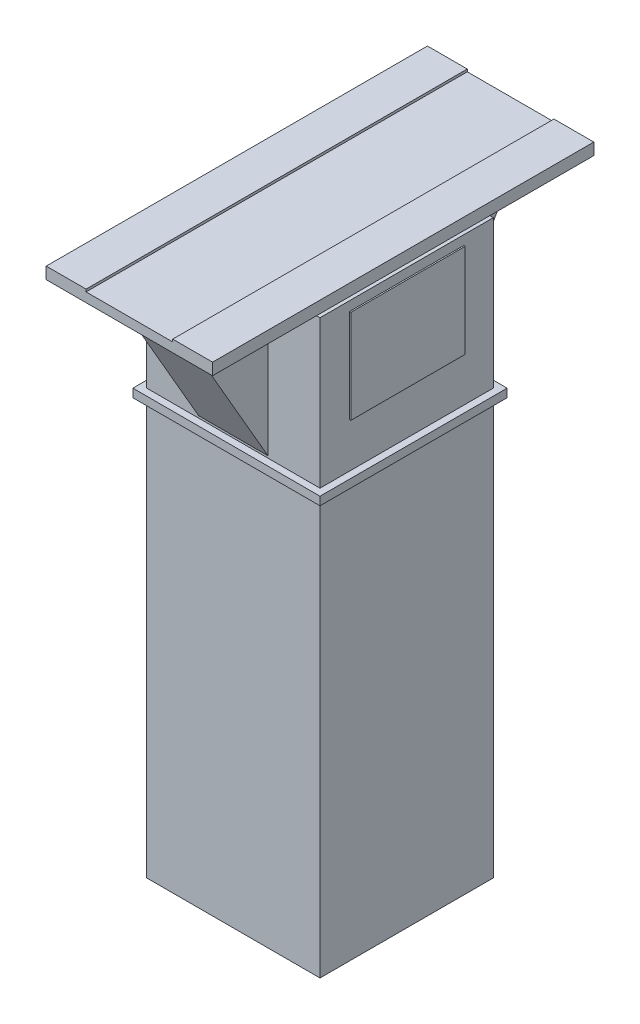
from build123d import *

# Parameters (mm, degrees)
SKIZZE1_W                         = 250
SKIZZE1_H                         = 250
AUFSATZ_LINEAR_AUSTRAGEN1_DEPTH   = 600
SKIZZE4_W                         = 270
SKIZZE4_H                         = 270
AUFSATZ_LINEAR_AUSTRAGEN4_DEPTH   = 12
SKIZZE5_W                         = 250
SKIZZE5_H                         = 250
AUFSATZ_LINEAR_AUSTRAGEN5_DEPTH   = 213
AUFSATZ_LINEAR_AUSTRAGEN6_DEPTH   = 275
AUFSATZ_LINEAR_AUSTRAGEN7_DEPTH   = 50
AUFSATZ_LINEAR_AUSTRAGEN7_2_DEPTH = 50
SKIZZE8_W                         = 165
SKIZZE8_H                         = 135
AUFSATZ_LINEAR_AUSTRAGEN8_DEPTH   = 127
SKIZZE9_R                         = 9
AUFSATZ_LINEAR_AUSTRAGEN9_DEPTH   = 12
LINEARES_MUSTER1_COUNT            = 6
LINEARES_MUSTER1_PITCH            = 100


with BuildPart() as part:
    # Skizze1 → Aufsatz-Linear austragen1 (new body)
    with BuildSketch(Plane(origin=(0, 0, 0), x_dir=(1, 0, 0), z_dir=(0, 1, 0))):
        Rectangle(SKIZZE1_W, SKIZZE1_H)
    extrude(amount=AUFSATZ_LINEAR_AUSTRAGEN1_DEPTH)


with BuildPart() as body_2:
    # Skizze4 → Aufsatz-Linear austragen4 (new body)
    with BuildSketch(Plane(origin=(0, 600, 0), x_dir=(1, 0, 0), z_dir=(0, 1, 0))):
        Rectangle(SKIZZE4_W, SKIZZE4_H)
    extrude(amount=AUFSATZ_LINEAR_AUSTRAGEN4_DEPTH)


with BuildPart() as body_3:
    # Skizze5 → Aufsatz-Linear austragen5 (new body)
    with BuildSketch(Plane(origin=(0, 612, 0), x_dir=(1, 0, 0), z_dir=(0, 1, 0))):
        Rectangle(SKIZZE5_W, SKIZZE5_H)
    extrude(amount=AUFSATZ_LINEAR_AUSTRAGEN5_DEPTH)

    # Skizze8 → Aufsatz-Linear austragen8 (add, symmetric)
    with BuildSketch(Plane.ZY):
        with Locations((0, 744)):
            Rectangle(SKIZZE8_W, SKIZZE8_H)
    extrude(amount=AUFSATZ_LINEAR_AUSTRAGEN8_DEPTH, both=True)


with BuildPart() as body_4:
    # Skizze6 → Aufsatz-Linear austragen6 (new, symmetric)
    with BuildSketch(Plane.XY):
        Polygon((-120, 825), (120, 825), (120, 842), (62.5, 842), (62.5, 838.5), (-62.5, 838.5), (-62.5, 842), (-120, 842), align=None)
    extrude(amount=AUFSATZ_LINEAR_AUSTRAGEN6_DEPTH, both=True)

    # Skizze9 → Aufsatz-Linear austragen9 (add)
    # profile 1 of 2: a face of its own
    with BuildSketch(Plane.XZ.offset(-825)):
        with Locations(Location((-75, 250, 0), (0, 0, 90))):
            Circle(SKIZZE9_R)
        Polygon((-75, 255.773502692), (-80, 252.886751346), (-80, 247.113248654), (-75, 244.226497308), (-70, 247.113248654), (-70, 252.886751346), align=None, mode=Mode.SUBTRACT)
    # profile 2 of 2: a face of its own
    with BuildSketch(Plane.XZ.offset(-825)):
        with Locations(Location((75, 250, 0), (0, 0, 90))):
            Circle(SKIZZE9_R)
        Polygon((75, 255.773502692), (70, 252.886751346), (70, 247.113248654), (75, 244.226497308), (80, 247.113248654), (80, 252.886751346), align=None, mode=Mode.SUBTRACT)
    aufsatz_linear_austragen9 = extrude(amount=AUFSATZ_LINEAR_AUSTRAGEN9_DEPTH)


with BuildPart() as body_5:
    # Skizze7 → Aufsatz-Linear austragen7 (new, symmetric)
    with BuildSketch(Plane(origin=(0, 0, 0), x_dir=(0, 0, -1), z_dir=(1, 0, 0))):
        Polygon((-246.24355653, 825), (-125, 615), (-125, 825), align=None)
    extrude(amount=AUFSATZ_LINEAR_AUSTRAGEN7_DEPTH, both=True)


with BuildPart() as body_6:
    # Skizze7 → Aufsatz-Linear austragen7 2 (new, symmetric)
    with BuildSketch(Plane(origin=(0, 0, 0), x_dir=(0, 0, -1), z_dir=(1, 0, 0))):
        Polygon((125, 825), (246.24355653, 825), (125, 615), align=None)
    extrude(amount=AUFSATZ_LINEAR_AUSTRAGEN7_2_DEPTH, both=True)


with BuildPart() as body_3_1:
    add(body_3.part)

    add(body_4.part)  # Lineares Muster1 merges body 4
    # Lineares Muster1: Aufsatz-Linear austragen9 ×6
    with Locations(*[(0, 0, -i * LINEARES_MUSTER1_PITCH) for i in range(1, LINEARES_MUSTER1_COUNT)]):
        add(aufsatz_linear_austragen9)


solid = Compound([part.part, body_2.part, body_5.part, body_6.part, body_3_1.part])
